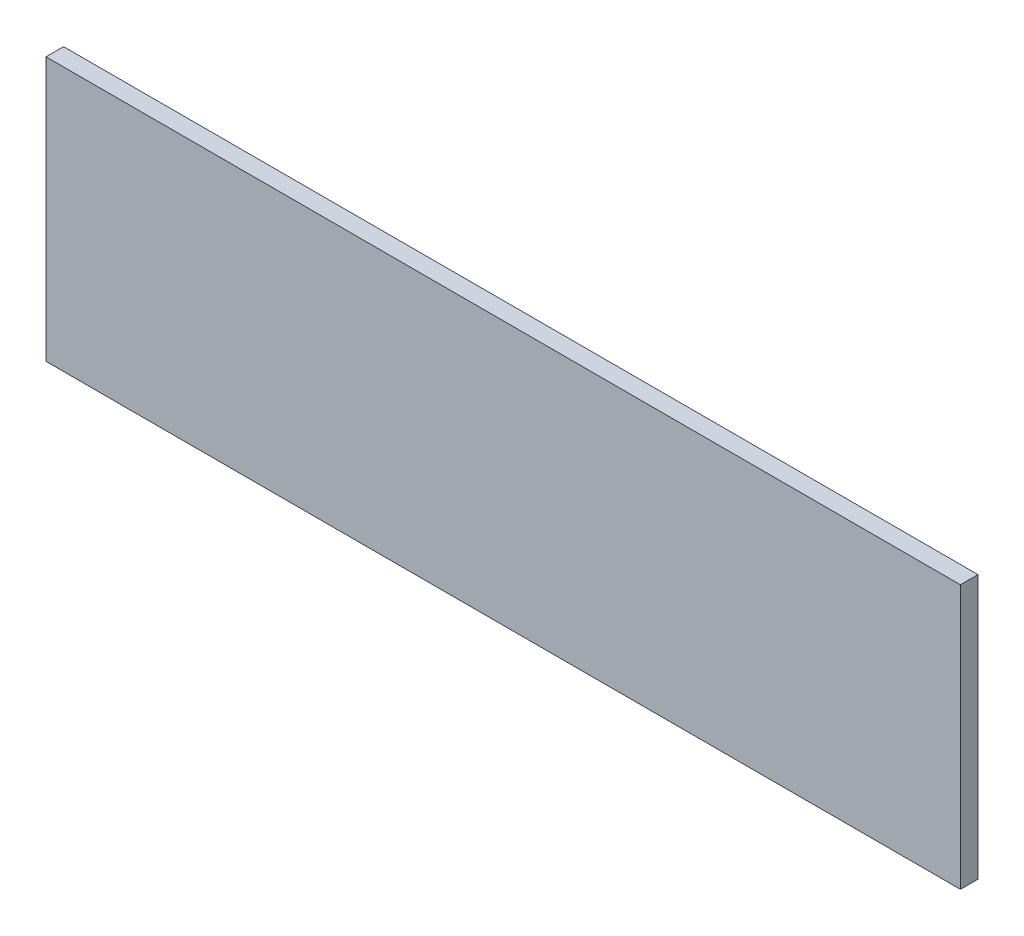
ISO-10303-21;
HEADER;
FILE_DESCRIPTION(('STEP AP214'),'2;1');
FILE_NAME('part.step','',(''),(''),'','','');
FILE_SCHEMA(('AUTOMOTIVE_DESIGN { 1 0 10303 214 1 1 1 1 }'));
ENDSEC;
DATA;
#1=APPLICATION_CONTEXT('core data for automotive mechanical design processes');
#2=APPLICATION_PROTOCOL_DEFINITION('international standard','automotive_design',2000,#1);
#3=PRODUCT_CONTEXT('',#1,'mechanical');
#4=PRODUCT('Part','Part','',(#3));
#5=PRODUCT_RELATED_PRODUCT_CATEGORY('part','',(#4));
#6=PRODUCT_DEFINITION_FORMATION('','',#4);
#7=PRODUCT_DEFINITION_CONTEXT('part definition',#1,'design');
#8=PRODUCT_DEFINITION('design','',#6,#7);
#9=PRODUCT_DEFINITION_SHAPE('','',#8);
#10=(LENGTH_UNIT() NAMED_UNIT(*) SI_UNIT(.MILLI.,.METRE.));
#11=(NAMED_UNIT(*) PLANE_ANGLE_UNIT() SI_UNIT($,.RADIAN.));
#12=(NAMED_UNIT(*) SI_UNIT($,.STERADIAN.) SOLID_ANGLE_UNIT());
#13=UNCERTAINTY_MEASURE_WITH_UNIT(LENGTH_MEASURE(1.E-05),#10,'distance_accuracy_value','');
#14=(GEOMETRIC_REPRESENTATION_CONTEXT(3) GLOBAL_UNCERTAINTY_ASSIGNED_CONTEXT((#13)) GLOBAL_UNIT_ASSIGNED_CONTEXT((#10,
#11,#12)) REPRESENTATION_CONTEXT('',''));
#15=CARTESIAN_POINT('',(0.,0.,0.));
#16=DIRECTION('',(0.,0.,1.));
#17=DIRECTION('',(1.,0.,0.));
#18=AXIS2_PLACEMENT_3D('',#15,#16,#17);
#19=CARTESIAN_POINT('',(0.,0.,1.5875));
#20=DIRECTION('',(1.,0.,0.));
#21=DIRECTION('',(0.,0.,-1.));
#22=AXIS2_PLACEMENT_3D('',#19,#20,#21);
#23=PLANE('',#22);
#24=DIRECTION('',(0.,-1.,0.));
#25=VECTOR('',#24,1.);
#26=CARTESIAN_POINT('',(0.,0.,0.));
#27=LINE('',#26,#25);
#28=CARTESIAN_POINT('',(0.,23.8125,0.));
#29=VERTEX_POINT('',#28);
#30=CARTESIAN_POINT('',(0.,0.,0.));
#31=VERTEX_POINT('',#30);
#32=EDGE_CURVE('E109',#29,#31,#27,.T.);
#33=ORIENTED_EDGE('',*,*,#32,.T.);
#34=DIRECTION('',(0.,0.,-1.));
#35=VECTOR('',#34,1.);
#36=CARTESIAN_POINT('',(0.,0.,1.5875));
#37=LINE('',#36,#35);
#38=CARTESIAN_POINT('',(0.,0.,1.5875));
#39=VERTEX_POINT('',#38);
#40=EDGE_CURVE('E11',#39,#31,#37,.T.);
#41=ORIENTED_EDGE('',*,*,#40,.F.);
#42=DIRECTION('',(0.,-1.,0.));
#43=VECTOR('',#42,1.);
#44=CARTESIAN_POINT('',(0.,0.,1.5875));
#45=LINE('',#44,#43);
#46=CARTESIAN_POINT('',(0.,23.8125,1.5875));
#47=VERTEX_POINT('',#46);
#48=EDGE_CURVE('E93',#47,#39,#45,.T.);
#49=ORIENTED_EDGE('',*,*,#48,.F.);
#50=DIRECTION('',(0.,0.,-1.));
#51=VECTOR('',#50,1.);
#52=CARTESIAN_POINT('',(0.,23.8125,1.5875));
#53=LINE('',#52,#51);
#54=EDGE_CURVE('E105',#47,#29,#53,.T.);
#55=ORIENTED_EDGE('',*,*,#54,.T.);
#56=EDGE_LOOP('',(#33,#41,#49,#55));
#57=FACE_BOUND('',#56,.T.);
#58=ADVANCED_FACE('F41',(#57),#23,.F.);
#59=CARTESIAN_POINT('',(0.,0.,1.5875));
#60=DIRECTION('',(0.,1.,0.));
#61=DIRECTION('',(0.,0.,1.));
#62=AXIS2_PLACEMENT_3D('',#59,#60,#61);
#63=PLANE('',#62);
#64=DIRECTION('',(1.,0.,0.));
#65=VECTOR('',#64,1.);
#66=CARTESIAN_POINT('',(0.,0.,0.));
#67=LINE('',#66,#65);
#68=CARTESIAN_POINT('',(82.55,0.,0.));
#69=VERTEX_POINT('',#68);
#70=EDGE_CURVE('E98',#31,#69,#67,.T.);
#71=ORIENTED_EDGE('',*,*,#70,.T.);
#72=DIRECTION('',(0.,0.,-1.));
#73=VECTOR('',#72,1.);
#74=CARTESIAN_POINT('',(82.55,0.,1.5875));
#75=LINE('',#74,#73);
#76=CARTESIAN_POINT('',(82.55,0.,1.5875));
#77=VERTEX_POINT('',#76);
#78=EDGE_CURVE('E50',#77,#69,#75,.T.);
#79=ORIENTED_EDGE('',*,*,#78,.F.);
#80=DIRECTION('',(1.,0.,0.));
#81=VECTOR('',#80,1.);
#82=CARTESIAN_POINT('',(0.,0.,1.5875));
#83=LINE('',#82,#81);
#84=EDGE_CURVE('E88',#39,#77,#83,.T.);
#85=ORIENTED_EDGE('',*,*,#84,.F.);
#86=ORIENTED_EDGE('',*,*,#40,.T.);
#87=EDGE_LOOP('',(#71,#79,#85,#86));
#88=FACE_BOUND('',#87,.T.);
#89=ADVANCED_FACE('F97',(#88),#63,.F.);
#90=CARTESIAN_POINT('',(82.55,0.,1.5875));
#91=DIRECTION('',(-1.,0.,0.));
#92=DIRECTION('',(0.,0.,1.));
#93=AXIS2_PLACEMENT_3D('',#90,#91,#92);
#94=PLANE('',#93);
#95=DIRECTION('',(0.,1.,0.));
#96=VECTOR('',#95,1.);
#97=CARTESIAN_POINT('',(82.55,0.,0.));
#98=LINE('',#97,#96);
#99=CARTESIAN_POINT('',(82.55,23.8125,0.));
#100=VERTEX_POINT('',#99);
#101=EDGE_CURVE('E75',#69,#100,#98,.T.);
#102=ORIENTED_EDGE('',*,*,#101,.T.);
#103=DIRECTION('',(0.,0.,-1.));
#104=VECTOR('',#103,1.);
#105=CARTESIAN_POINT('',(82.55,23.8125,1.5875));
#106=LINE('',#105,#104);
#107=CARTESIAN_POINT('',(82.55,23.8125,1.5875));
#108=VERTEX_POINT('',#107);
#109=EDGE_CURVE('E100',#108,#100,#106,.T.);
#110=ORIENTED_EDGE('',*,*,#109,.F.);
#111=DIRECTION('',(0.,1.,0.));
#112=VECTOR('',#111,1.);
#113=CARTESIAN_POINT('',(82.55,0.,1.5875));
#114=LINE('',#113,#112);
#115=EDGE_CURVE('E91',#77,#108,#114,.T.);
#116=ORIENTED_EDGE('',*,*,#115,.F.);
#117=ORIENTED_EDGE('',*,*,#78,.T.);
#118=EDGE_LOOP('',(#102,#110,#116,#117));
#119=FACE_BOUND('',#118,.T.);
#120=ADVANCED_FACE('F101',(#119),#94,.F.);
#121=CARTESIAN_POINT('',(0.,23.8125,1.5875));
#122=DIRECTION('',(0.,-1.,0.));
#123=DIRECTION('',(0.,0.,-1.));
#124=AXIS2_PLACEMENT_3D('',#121,#122,#123);
#125=PLANE('',#124);
#126=DIRECTION('',(-1.,0.,0.));
#127=VECTOR('',#126,1.);
#128=CARTESIAN_POINT('',(0.,23.8125,0.));
#129=LINE('',#128,#127);
#130=EDGE_CURVE('E81',#100,#29,#129,.T.);
#131=ORIENTED_EDGE('',*,*,#130,.T.);
#132=ORIENTED_EDGE('',*,*,#54,.F.);
#133=DIRECTION('',(-1.,0.,0.));
#134=VECTOR('',#133,1.);
#135=CARTESIAN_POINT('',(0.,23.8125,1.5875));
#136=LINE('',#135,#134);
#137=EDGE_CURVE('E58',#108,#47,#136,.T.);
#138=ORIENTED_EDGE('',*,*,#137,.F.);
#139=ORIENTED_EDGE('',*,*,#109,.T.);
#140=EDGE_LOOP('',(#131,#132,#138,#139));
#141=FACE_BOUND('',#140,.T.);
#142=ADVANCED_FACE('F122',(#141),#125,.F.);
#143=CARTESIAN_POINT('',(0.,0.,1.5875));
#144=DIRECTION('',(0.,0.,-1.));
#145=DIRECTION('',(-1.,0.,0.));
#146=AXIS2_PLACEMENT_3D('',#143,#144,#145);
#147=PLANE('',#146);
#148=ORIENTED_EDGE('',*,*,#48,.T.);
#149=ORIENTED_EDGE('',*,*,#84,.T.);
#150=ORIENTED_EDGE('',*,*,#115,.T.);
#151=ORIENTED_EDGE('',*,*,#137,.T.);
#152=EDGE_LOOP('',(#148,#149,#150,#151));
#153=FACE_BOUND('',#152,.T.);
#154=ADVANCED_FACE('F89',(#153),#147,.F.);
#155=CARTESIAN_POINT('',(0.,0.,0.));
#156=DIRECTION('',(0.,0.,-1.));
#157=DIRECTION('',(-1.,0.,0.));
#158=AXIS2_PLACEMENT_3D('',#155,#156,#157);
#159=PLANE('',#158);
#160=ORIENTED_EDGE('',*,*,#32,.F.);
#161=ORIENTED_EDGE('',*,*,#130,.F.);
#162=ORIENTED_EDGE('',*,*,#101,.F.);
#163=ORIENTED_EDGE('',*,*,#70,.F.);
#164=EDGE_LOOP('',(#160,#161,#162,#163));
#165=FACE_BOUND('',#164,.T.);
#166=ADVANCED_FACE('F125',(#165),#159,.T.);
#167=CLOSED_SHELL('',(#58,#89,#120,#142,#154,#166));
#168=MANIFOLD_SOLID_BREP('B2',#167);
#169=ADVANCED_BREP_SHAPE_REPRESENTATION('',(#18,#168),#14);
#170=SHAPE_DEFINITION_REPRESENTATION(#9,#169);
ENDSEC;
END-ISO-10303-21;
